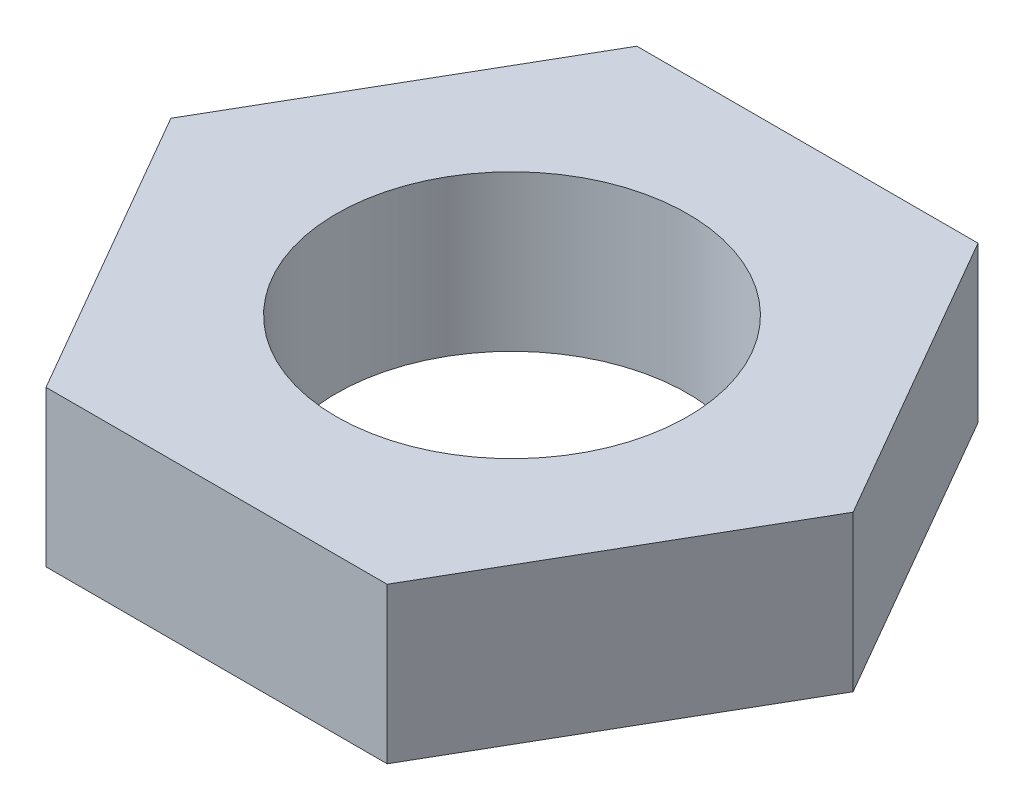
from build123d import *

# Parameters (mm, degrees)
ESQUISSE1_R      = 5.65
EXTRUSION1_DEPTH = 5


with BuildPart() as part:
    # Esquisse1 → Extrusion1 (new body)
    with BuildSketch(Plane(origin=(0, 0, 0), x_dir=(1, 0, 0), z_dir=(0, 1, 0))):
        Polygon((5.484827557, -9.5), (10.969655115, 0), (5.484827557, 9.5), (-5.484827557, 9.5), (-10.969655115, 0), (-5.484827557, -9.5), align=None)
        with Locations(Location((0, 0, 0), (0, 0, 270))):
            Circle(ESQUISSE1_R, mode=Mode.SUBTRACT)
    extrude(amount=EXTRUSION1_DEPTH)


solid = part.part
